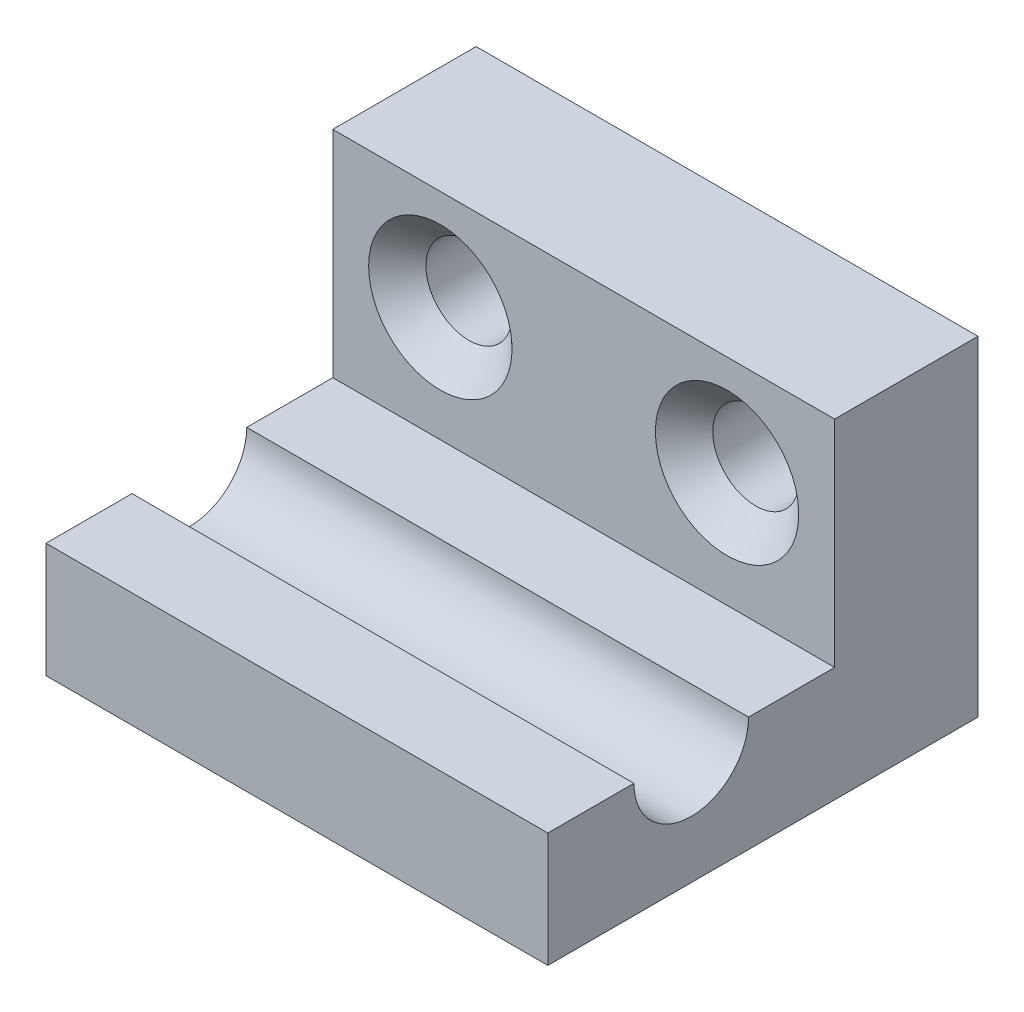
from build123d import *

# Parameters (mm, degrees)
BOSS_EXTRU_1_DEPTH      = 35
ESQUISSE2_R             = 3
ENL_V_MAT_EXTRU_1_DEPTH = 40
CHANFREIN1_SIZE         = 2
ESQUISSE3_R             = 4
ENL_V_MAT_EXTRU_2_DEPTH = 40


with BuildPart() as part:
    # Esquisse1 → Boss.-Extru.1 (new body)
    with BuildSketch(Plane(origin=(0, 0, 0), x_dir=(0, 0, -1), z_dir=(1, 0, 0))):
        Polygon((0, 0), (0, 23), (-10, 23), (-10, 8), (-30, 8), (-30, 0), align=None)
    extrude(amount=BOSS_EXTRU_1_DEPTH)

    # Esquisse2 → Enl_v. mat.-Extru.1 (cut)
    with BuildSketch(Plane.XY.offset(10)):
        with Locations((7.5, 16)):
            Circle(ESQUISSE2_R)
        with Locations((27.5, 16)):
            Circle(ESQUISSE2_R)
    extrude(amount=-ENL_V_MAT_EXTRU_1_DEPTH, mode=Mode.SUBTRACT)

    # Chanfrein1
    chanfrein1_edges = [part.edges().sort_by_distance(p)[0] for p in [
        (4.5, 16, 10),
        (24.5, 16, 10),
    ]]
    chamfer(chanfrein1_edges, length=CHANFREIN1_SIZE)

    # Esquisse3 → Enl_v. mat.-Extru.2 (cut)
    with BuildSketch(Plane(origin=(35, 0, 0), x_dir=(0, 0, -1), z_dir=(1, 0, 0))):
        with Locations((-20, 8)):
            Circle(ESQUISSE3_R)
    extrude(amount=-ENL_V_MAT_EXTRU_2_DEPTH, mode=Mode.SUBTRACT)


solid = part.part
